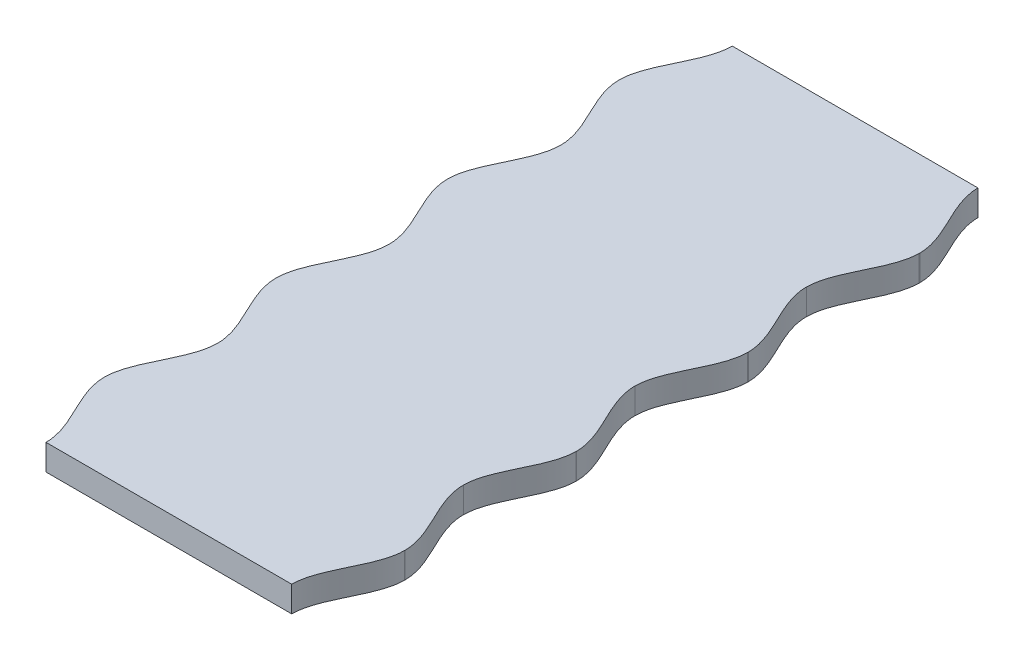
from build123d import *

# Parameters (mm, degrees)
BOSS_EXTRUDE1_DEPTH = 3


with BuildPart() as part:
    # Sketch2 → Boss-Extrude1 (new body)
    with BuildSketch(Plane(origin=(0, 0, 0), x_dir=(1, 0, 0), z_dir=(0, 1, 0))):
        with BuildLine():
            Line((-14.31965, 80), (14.31965, 80))
            add(Edge.make_bspline(
                [(14.31965, 80), (14.31965, 76.6816), (17.47275, 73.3629), (17.50075, 70.0446)],
                knots=[0.038461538, 0.038461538, 0.038461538, 0.038461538, 0.076923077, 0.076923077, 0.076923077, 0.076923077], degree=3))
            Line((17.50075, 70.0446), (17.50075, 69.9552))
            add(Edge.make_bspline(
                [(17.50075, 69.9552), (17.47275, 66.6368), (14.31965, 63.3183), (14.31965, 59.9999)],
                knots=[0.115384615, 0.115384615, 0.115384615, 0.115384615, 0.153846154, 0.153846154, 0.153846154, 0.153846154], degree=3))
            add(Edge.make_bspline(
                [(14.31965, 59.9999), (14.31965, 56.6815), (17.47275, 53.363), (17.50075, 50.0446)],
                knots=[0.153846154, 0.153846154, 0.153846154, 0.153846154, 0.192307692, 0.192307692, 0.192307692, 0.192307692], degree=3))
            Line((17.50075, 50.0446), (17.50075, 49.9553))
            add(Edge.make_bspline(
                [(17.50075, 49.9553), (17.47275, 46.6369), (14.31965, 43.3183), (14.31965, 39.9999)],
                knots=[0.230769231, 0.230769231, 0.230769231, 0.230769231, 0.269230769, 0.269230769, 0.269230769, 0.269230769], degree=3))
            add(Edge.make_bspline(
                [(14.31965, 39.9999), (14.31965, 36.6815), (17.47275, 33.363), (17.50075, 30.0446)],
                knots=[0.269230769, 0.269230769, 0.269230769, 0.269230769, 0.307692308, 0.307692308, 0.307692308, 0.307692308], degree=3))
            Line((17.50075, 30.0446), (17.50075, 29.9553))
            add(Edge.make_bspline(
                [(17.50075, 29.9553), (17.47275, 26.6369), (14.31965, 23.3184), (14.31965, 20)],
                knots=[0.346153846, 0.346153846, 0.346153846, 0.346153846, 0.384615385, 0.384615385, 0.384615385, 0.384615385], degree=3))
            add(Edge.make_bspline(
                [(14.31965, 20), (14.31965, 16.6816), (17.47275, 13.363), (17.50075, 10.0447)],
                knots=[0.384615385, 0.384615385, 0.384615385, 0.384615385, 0.423076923, 0.423076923, 0.423076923, 0.423076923], degree=3))
            Line((17.50075, 10.0447), (17.50075, 9.9553))
            add(Edge.make_bspline(
                [(17.50075, 9.9553), (17.47275, 6.6369), (14.31965, 3.3184), (14.31965, 0)],
                knots=[0.461538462, 0.461538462, 0.461538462, 0.461538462, 0.5, 0.5, 0.5, 0.5], degree=3))
            Line((14.31965, 0), (-14.31965, 0))
            add(Edge.make_bspline(
                [(-14.31965, 0), (-14.31965, 3.2812), (-17.40275, 6.5625), (-17.49925, 9.8437)],
                knots=[0.538461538, 0.538461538, 0.538461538, 0.538461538, 0.576923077, 0.576923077, 0.576923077, 0.576923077], degree=3))
            Line((-17.49925, 9.8437), (-17.49925, 10.1563))
            add(Edge.make_bspline(
                [(-17.49925, 10.1563), (-17.40275, 13.4374), (-14.31965, 16.7188), (-14.31965, 20)],
                knots=[0.615384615, 0.615384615, 0.615384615, 0.615384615, 0.653846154, 0.653846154, 0.653846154, 0.653846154], degree=3))
            add(Edge.make_bspline(
                [(-14.31965, 20), (-14.31965, 23.2812), (-17.40275, 26.5625), (-17.49925, 29.8437)],
                knots=[0.653846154, 0.653846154, 0.653846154, 0.653846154, 0.692307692, 0.692307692, 0.692307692, 0.692307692], degree=3))
            Line((-17.49925, 29.8437), (-17.49925, 30.1562))
            add(Edge.make_bspline(
                [(-17.49925, 30.1562), (-17.40275, 33.4374), (-14.31965, 36.7187), (-14.31965, 39.9999)],
                knots=[0.730769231, 0.730769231, 0.730769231, 0.730769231, 0.769230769, 0.769230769, 0.769230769, 0.769230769], degree=3))
            add(Edge.make_bspline(
                [(-14.31965, 39.9999), (-14.31965, 43.2811), (-17.40275, 46.5625), (-17.49925, 49.8437)],
                knots=[0.769230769, 0.769230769, 0.769230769, 0.769230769, 0.807692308, 0.807692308, 0.807692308, 0.807692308], degree=3))
            Line((-17.49925, 49.8437), (-17.49925, 50.1562))
            add(Edge.make_bspline(
                [(-17.49925, 50.1562), (-17.40275, 53.4374), (-14.31965, 56.7187), (-14.31965, 59.9999)],
                knots=[0.846153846, 0.846153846, 0.846153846, 0.846153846, 0.884615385, 0.884615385, 0.884615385, 0.884615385], degree=3))
            add(Edge.make_bspline(
                [(-14.31965, 59.9999), (-14.31965, 63.2811), (-17.40275, 66.5624), (-17.49925, 69.8436)],
                knots=[0.884615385, 0.884615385, 0.884615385, 0.884615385, 0.923076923, 0.923076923, 0.923076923, 0.923076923], degree=3))
            Line((-17.49925, 69.8436), (-17.49925, 70.1561))
            add(Edge.make_bspline(
                [(-17.49925, 70.1561), (-17.40275, 73.4373), (-14.31965, 76.7188), (-14.31965, 80)],
                knots=[0.961538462, 0.961538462, 0.961538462, 0.961538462, 1, 1, 1, 1], degree=3))
        make_face()
    extrude(amount=BOSS_EXTRUDE1_DEPTH)


solid = part.part
